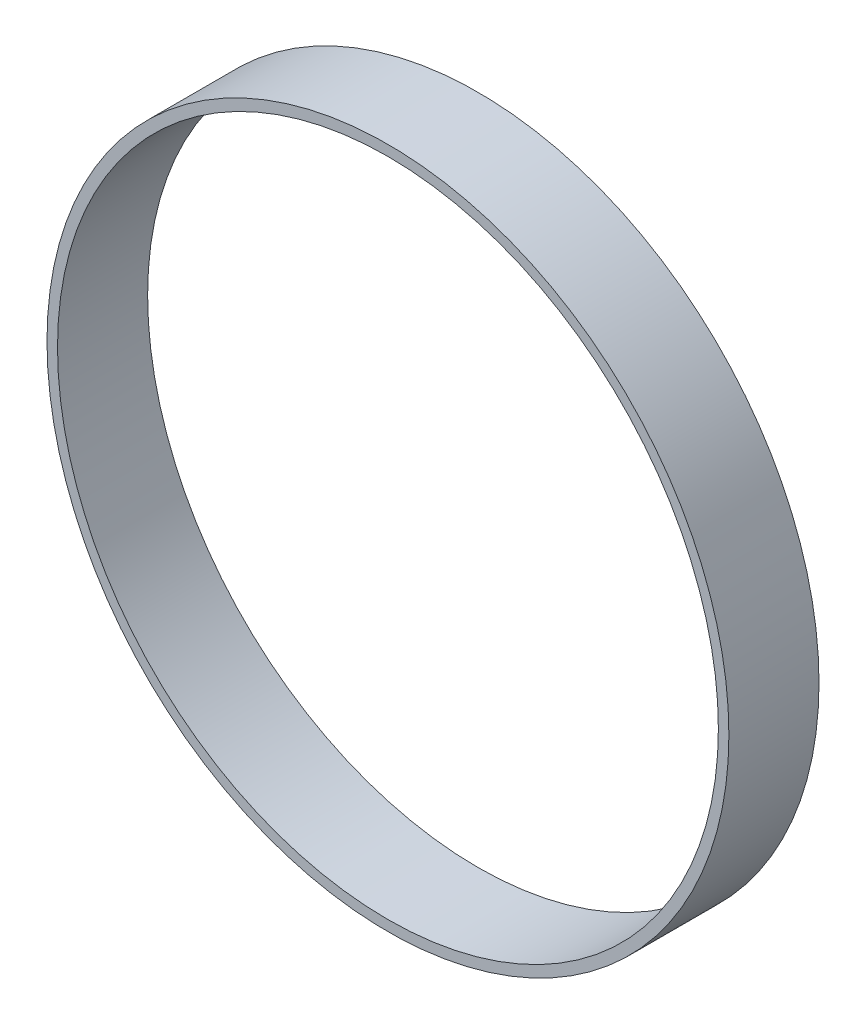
from build123d import *

# Parameters (mm, degrees)
ESQUISSE1_R      = 22.7
ESQUISSE1_R_2    = 22
EXTRUSION1_DEPTH = 6


with BuildPart() as part:
    # Esquisse1 → Extrusion1 (new body)
    with BuildSketch(Plane.XY):
        Circle(ESQUISSE1_R)
        Circle(ESQUISSE1_R_2, mode=Mode.SUBTRACT)
    extrude(amount=EXTRUSION1_DEPTH)


solid = part.part
